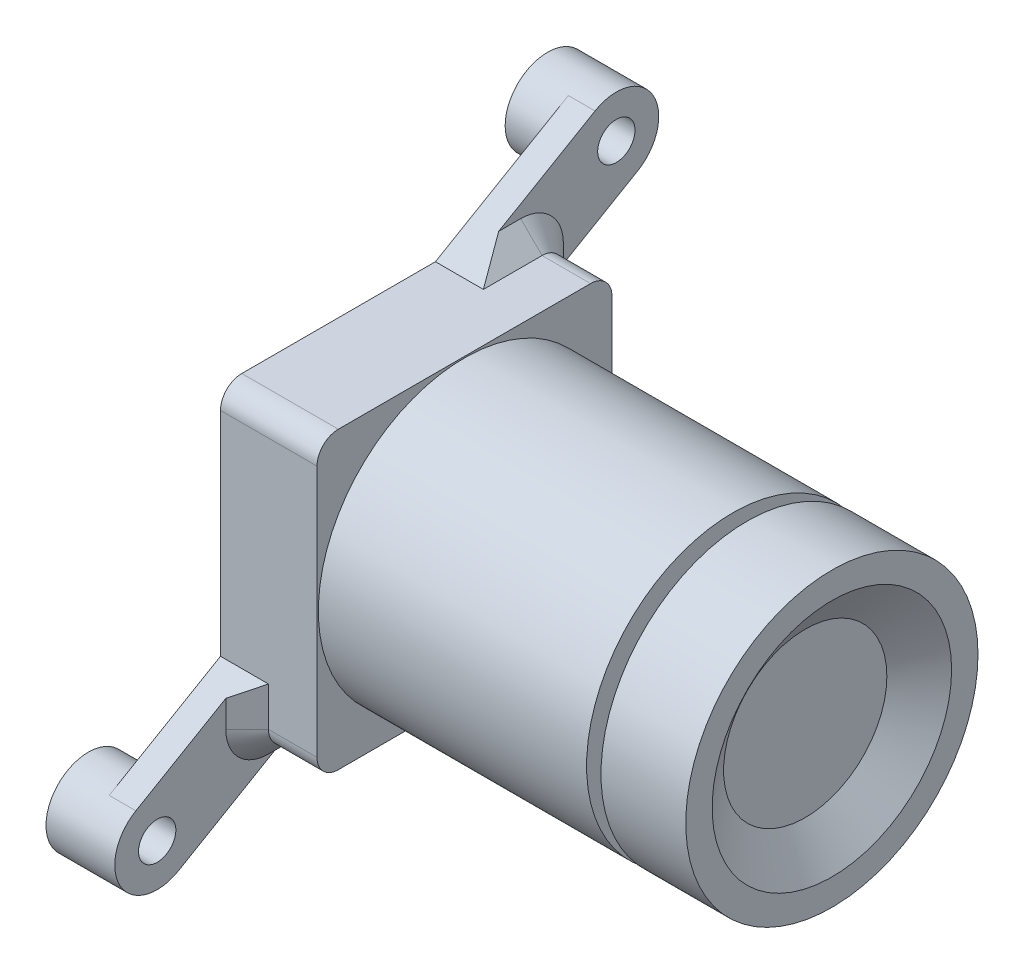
ISO-10303-21;
HEADER;
FILE_DESCRIPTION(('STEP AP214'),'2;1');
FILE_NAME('part.step','',(''),(''),'','','');
FILE_SCHEMA(('AUTOMOTIVE_DESIGN { 1 0 10303 214 1 1 1 1 }'));
ENDSEC;
DATA;
#1=APPLICATION_CONTEXT('core data for automotive mechanical design processes');
#2=APPLICATION_PROTOCOL_DEFINITION('international standard','automotive_design',2000,#1);
#3=PRODUCT_CONTEXT('',#1,'mechanical');
#4=PRODUCT('Part','Part','',(#3));
#5=PRODUCT_RELATED_PRODUCT_CATEGORY('part','',(#4));
#6=PRODUCT_DEFINITION_FORMATION('','',#4);
#7=PRODUCT_DEFINITION_CONTEXT('part definition',#1,'design');
#8=PRODUCT_DEFINITION('design','',#6,#7);
#9=PRODUCT_DEFINITION_SHAPE('','',#8);
#10=(LENGTH_UNIT() NAMED_UNIT(*) SI_UNIT(.MILLI.,.METRE.));
#11=(NAMED_UNIT(*) PLANE_ANGLE_UNIT() SI_UNIT($,.RADIAN.));
#12=(NAMED_UNIT(*) SI_UNIT($,.STERADIAN.) SOLID_ANGLE_UNIT());
#13=UNCERTAINTY_MEASURE_WITH_UNIT(LENGTH_MEASURE(1.E-05),#10,'distance_accuracy_value','');
#14=(GEOMETRIC_REPRESENTATION_CONTEXT(3) GLOBAL_UNCERTAINTY_ASSIGNED_CONTEXT((#13)) GLOBAL_UNIT_ASSIGNED_CONTEXT((#10,
#11,#12)) REPRESENTATION_CONTEXT('',''));
#15=CARTESIAN_POINT('',(0.,0.,0.));
#16=DIRECTION('',(0.,0.,1.));
#17=DIRECTION('',(1.,0.,0.));
#18=AXIS2_PLACEMENT_3D('',#15,#16,#17);
#19=CARTESIAN_POINT('',(-4.5974,-7.0231,7.0231));
#20=DIRECTION('',(1.,0.,0.));
#21=DIRECTION('',(0.,0.,-1.));
#22=AXIS2_PLACEMENT_3D('',#19,#20,#21);
#23=PLANE('',#22);
#24=CARTESIAN_POINT('',(-4.5974,-8.9662,11.3078271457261));
#25=DIRECTION('',(-1.,0.,0.));
#26=DIRECTION('',(0.,0.,1.));
#27=AXIS2_PLACEMENT_3D('',#24,#25,#26);
#28=CIRCLE('',#27,2.0193);
#29=CARTESIAN_POINT('',(-4.5974,-7.22128100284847,12.3241096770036));
#30=VERTEX_POINT('',#29);
#31=CARTESIAN_POINT('',(-4.5974,-10.7111189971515,10.2915446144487));
#32=VERTEX_POINT('',#31);
#33=EDGE_CURVE('E181',#30,#32,#28,.T.);
#34=ORIENTED_EDGE('',*,*,#33,.F.);
#35=DIRECTION('',(0.,0.503284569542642,-0.864120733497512));
#36=VECTOR('',#35,1.);
#37=CARTESIAN_POINT('',(-4.5974,-8.23756353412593,14.0690286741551));
#38=LINE('',#37,#36);
#39=CARTESIAN_POINT('',(-4.5974,-4.13384626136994,7.0231));
#40=VERTEX_POINT('',#39);
#41=EDGE_CURVE('E167',#30,#40,#38,.T.);
#42=ORIENTED_EDGE('',*,*,#41,.T.);
#43=DIRECTION('',(0.,-1.,0.));
#44=VECTOR('',#43,1.);
#45=CARTESIAN_POINT('',(-4.5974,7.0231,7.0231));
#46=LINE('',#45,#44);
#47=CARTESIAN_POINT('',(-4.5974,6.0071,7.0231));
#48=VERTEX_POINT('',#47);
#49=EDGE_CURVE('E268',#48,#40,#46,.T.);
#50=ORIENTED_EDGE('',*,*,#49,.F.);
#51=CARTESIAN_POINT('',(-4.5974,6.0071,6.0071));
#52=DIRECTION('',(1.,0.,0.));
#53=DIRECTION('',(0.,0.,-1.));
#54=AXIS2_PLACEMENT_3D('',#51,#52,#53);
#55=CIRCLE('',#54,1.016);
#56=CARTESIAN_POINT('',(-4.5974,7.0231,6.0071));
#57=VERTEX_POINT('',#56);
#58=EDGE_CURVE('E297',#48,#57,#55,.F.);
#59=ORIENTED_EDGE('',*,*,#58,.T.);
#60=DIRECTION('',(0.,0.,1.));
#61=VECTOR('',#60,1.);
#62=CARTESIAN_POINT('',(-4.5974,7.0231,7.0231));
#63=LINE('',#62,#61);
#64=CARTESIAN_POINT('',(-4.5974,7.0231,-3.2131));
#65=VERTEX_POINT('',#64);
#66=EDGE_CURVE('E276',#65,#57,#63,.T.);
#67=ORIENTED_EDGE('',*,*,#66,.F.);
#68=DIRECTION('',(0.,0.503284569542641,-0.864120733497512));
#69=VECTOR('',#68,1.);
#70=CARTESIAN_POINT('',(-4.5974,7.0231,-3.2131));
#71=LINE('',#70,#69);
#72=CARTESIAN_POINT('',(-4.5974,10.7111189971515,-9.54529032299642));
#73=VERTEX_POINT('',#72);
#74=EDGE_CURVE('E218',#65,#73,#71,.T.);
#75=ORIENTED_EDGE('',*,*,#74,.T.);
#76=CARTESIAN_POINT('',(-4.5974,8.9662,-10.5615728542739));
#77=DIRECTION('',(-1.,0.,0.));
#78=DIRECTION('',(0.,0.,1.));
#79=AXIS2_PLACEMENT_3D('',#76,#77,#78);
#80=CIRCLE('',#79,2.0193);
#81=CARTESIAN_POINT('',(-4.5974,7.22128100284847,-11.5778553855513));
#82=VERTEX_POINT('',#81);
#83=EDGE_CURVE('E11',#82,#73,#80,.T.);
#84=ORIENTED_EDGE('',*,*,#83,.F.);
#85=DIRECTION('',(0.,-0.503284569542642,0.864120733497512));
#86=VECTOR('',#85,1.);
#87=CARTESIAN_POINT('',(-4.5974,4.56848259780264,-7.0231));
#88=LINE('',#87,#86);
#89=CARTESIAN_POINT('',(-4.5974,4.56848259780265,-7.0231));
#90=VERTEX_POINT('',#89);
#91=EDGE_CURVE('E224',#82,#90,#88,.T.);
#92=ORIENTED_EDGE('',*,*,#91,.T.);
#93=DIRECTION('',(0.,1.,0.));
#94=VECTOR('',#93,1.);
#95=CARTESIAN_POINT('',(-4.5974,7.0231,-7.0231));
#96=LINE('',#95,#94);
#97=CARTESIAN_POINT('',(-4.5974,-6.0071,-7.0231));
#98=VERTEX_POINT('',#97);
#99=EDGE_CURVE('E273',#98,#90,#96,.T.);
#100=ORIENTED_EDGE('',*,*,#99,.F.);
#101=CARTESIAN_POINT('',(-4.5974,-6.0071,-6.0071));
#102=DIRECTION('',(1.,0.,0.));
#103=DIRECTION('',(0.,0.,-1.));
#104=AXIS2_PLACEMENT_3D('',#101,#102,#103);
#105=CIRCLE('',#104,1.016);
#106=CARTESIAN_POINT('',(-4.5974,-7.0231,-6.0071));
#107=VERTEX_POINT('',#106);
#108=EDGE_CURVE('E299',#98,#107,#105,.F.);
#109=ORIENTED_EDGE('',*,*,#108,.T.);
#110=DIRECTION('',(0.,0.,-1.));
#111=VECTOR('',#110,1.);
#112=CARTESIAN_POINT('',(-4.5974,-7.0231,7.0231));
#113=LINE('',#112,#111);
#114=CARTESIAN_POINT('',(-4.5974,-7.0231,3.95935429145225));
#115=VERTEX_POINT('',#114);
#116=EDGE_CURVE('E270',#115,#107,#113,.T.);
#117=ORIENTED_EDGE('',*,*,#116,.F.);
#118=DIRECTION('',(0.,-0.503284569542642,0.864120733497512));
#119=VECTOR('',#118,1.);
#120=CARTESIAN_POINT('',(-4.5974,-7.0231,3.95935429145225));
#121=LINE('',#120,#119);
#122=EDGE_CURVE('E177',#115,#32,#121,.T.);
#123=ORIENTED_EDGE('',*,*,#122,.T.);
#124=EDGE_LOOP('',(#34,#42,#50,#59,#67,#75,#84,#92,#100,#109,#117,#123));
#125=FACE_BOUND('',#124,.T.);
#126=ADVANCED_FACE('F30',(#125),#23,.F.);
#127=CARTESIAN_POINT('',(-3.3274,-8.9662,11.3078271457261));
#128=DIRECTION('',(-1.,0.,0.));
#129=DIRECTION('',(0.,0.,1.));
#130=AXIS2_PLACEMENT_3D('',#127,#128,#129);
#131=CYLINDRICAL_SURFACE('',#130,2.0193);
#132=DIRECTION('',(-1.,0.,0.));
#133=VECTOR('',#132,1.);
#134=CARTESIAN_POINT('',(-3.3274,-10.7111189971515,10.2915446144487));
#135=LINE('',#134,#133);
#136=CARTESIAN_POINT('',(-3.3274,-10.7111189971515,10.2915446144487));
#137=VERTEX_POINT('',#136);
#138=EDGE_CURVE('E182',#137,#32,#135,.T.);
#139=ORIENTED_EDGE('',*,*,#138,.F.);
#140=CARTESIAN_POINT('',(-3.3274,-8.9662,11.3078271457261));
#141=DIRECTION('',(1.,0.,0.));
#142=DIRECTION('',(0.,0.,-1.));
#143=AXIS2_PLACEMENT_3D('',#140,#141,#142);
#144=CIRCLE('',#143,2.0193);
#145=CARTESIAN_POINT('',(-3.3274,-7.22128100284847,12.3241096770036));
#146=VERTEX_POINT('',#145);
#147=EDGE_CURVE('E39',#146,#137,#144,.T.);
#148=ORIENTED_EDGE('',*,*,#147,.F.);
#149=DIRECTION('',(-1.,0.,0.));
#150=VECTOR('',#149,1.);
#151=CARTESIAN_POINT('',(-3.3274,-7.22128100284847,12.3241096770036));
#152=LINE('',#151,#150);
#153=EDGE_CURVE('E169',#30,#146,#152,.F.);
#154=ORIENTED_EDGE('',*,*,#153,.F.);
#155=ORIENTED_EDGE('',*,*,#33,.T.);
#156=EDGE_LOOP('',(#139,#148,#154,#155));
#157=FACE_BOUND('',#156,.T.);
#158=CARTESIAN_POINT('',(-6.604,-8.9662,11.3078271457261));
#159=DIRECTION('',(-1.,0.,0.));
#160=DIRECTION('',(0.,0.,1.));
#161=AXIS2_PLACEMENT_3D('',#158,#159,#160);
#162=CIRCLE('',#161,2.0193);
#163=CARTESIAN_POINT('',(-6.604,-8.9662,13.3271271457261));
#164=VERTEX_POINT('',#163);
#165=EDGE_CURVE('E187',#164,#164,#162,.T.);
#166=ORIENTED_EDGE('',*,*,#165,.F.);
#167=EDGE_LOOP('',(#166));
#168=FACE_BOUND('',#167,.T.);
#169=ADVANCED_FACE('F32',(#157,#168),#131,.T.);
#170=CARTESIAN_POINT('',(-3.3274,8.9662,-10.5615728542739));
#171=DIRECTION('',(-1.,0.,0.));
#172=DIRECTION('',(0.,0.,1.));
#173=AXIS2_PLACEMENT_3D('',#170,#171,#172);
#174=CYLINDRICAL_SURFACE('',#173,2.0193);
#175=DIRECTION('',(-1.,0.,0.));
#176=VECTOR('',#175,1.);
#177=CARTESIAN_POINT('',(-3.3274,10.7111189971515,-9.54529032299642));
#178=LINE('',#177,#176);
#179=CARTESIAN_POINT('',(-3.3274,10.7111189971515,-9.54529032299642));
#180=VERTEX_POINT('',#179);
#181=EDGE_CURVE('E349',#180,#73,#178,.T.);
#182=ORIENTED_EDGE('',*,*,#181,.F.);
#183=CARTESIAN_POINT('',(-3.3274,8.9662,-10.5615728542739));
#184=DIRECTION('',(1.,0.,0.));
#185=DIRECTION('',(0.,0.,-1.));
#186=AXIS2_PLACEMENT_3D('',#183,#184,#185);
#187=CIRCLE('',#186,2.0193);
#188=CARTESIAN_POINT('',(-3.3274,7.22128100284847,-11.5778553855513));
#189=VERTEX_POINT('',#188);
#190=EDGE_CURVE('E350',#189,#180,#187,.T.);
#191=ORIENTED_EDGE('',*,*,#190,.F.);
#192=DIRECTION('',(-1.,0.,0.));
#193=VECTOR('',#192,1.);
#194=CARTESIAN_POINT('',(-3.3274,7.22128100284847,-11.5778553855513));
#195=LINE('',#194,#193);
#196=EDGE_CURVE('E352',#82,#189,#195,.F.);
#197=ORIENTED_EDGE('',*,*,#196,.F.);
#198=ORIENTED_EDGE('',*,*,#83,.T.);
#199=EDGE_LOOP('',(#182,#191,#197,#198));
#200=FACE_BOUND('',#199,.T.);
#201=CARTESIAN_POINT('',(-6.604,8.9662,-10.5615728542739));
#202=DIRECTION('',(-1.,0.,0.));
#203=DIRECTION('',(0.,0.,1.));
#204=AXIS2_PLACEMENT_3D('',#201,#202,#203);
#205=CIRCLE('',#204,2.0193);
#206=CARTESIAN_POINT('',(-6.604,8.9662,-8.54227285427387));
#207=VERTEX_POINT('',#206);
#208=EDGE_CURVE('E191',#207,#207,#205,.T.);
#209=ORIENTED_EDGE('',*,*,#208,.F.);
#210=EDGE_LOOP('',(#209));
#211=FACE_BOUND('',#210,.T.);
#212=ADVANCED_FACE('F375',(#200,#211),#174,.T.);
#213=CARTESIAN_POINT('',(12.7762,0.,0.));
#214=DIRECTION('',(1.,0.,0.));
#215=DIRECTION('',(0.,0.,-1.));
#216=AXIS2_PLACEMENT_3D('',#213,#214,#215);
#217=PLANE('',#216);
#218=CARTESIAN_POINT('',(12.7762,0.,0.));
#219=DIRECTION('',(1.,0.,0.));
#220=DIRECTION('',(0.,0.,-1.));
#221=AXIS2_PLACEMENT_3D('',#218,#219,#220);
#222=CIRCLE('',#221,6.9596);
#223=CARTESIAN_POINT('',(12.7762,0.,-6.9596));
#224=VERTEX_POINT('',#223);
#225=EDGE_CURVE('E253',#224,#224,#222,.T.);
#226=ORIENTED_EDGE('',*,*,#225,.T.);
#227=EDGE_LOOP('',(#226));
#228=FACE_BOUND('',#227,.T.);
#229=CARTESIAN_POINT('',(12.7762,0.,0.));
#230=DIRECTION('',(1.,0.,0.));
#231=DIRECTION('',(0.,0.,-1.));
#232=AXIS2_PLACEMENT_3D('',#229,#230,#231);
#233=CIRCLE('',#232,5.5626);
#234=CARTESIAN_POINT('',(12.7762,0.,-5.5626));
#235=VERTEX_POINT('',#234);
#236=EDGE_CURVE('E244',#235,#235,#233,.T.);
#237=ORIENTED_EDGE('',*,*,#236,.F.);
#238=EDGE_LOOP('',(#237));
#239=FACE_BOUND('',#238,.T.);
#240=ADVANCED_FACE('F475',(#228,#239),#217,.T.);
#241=CARTESIAN_POINT('',(0.,-7.0231,7.0231));
#242=DIRECTION('',(1.,0.,0.));
#243=DIRECTION('',(0.,0.,-1.));
#244=AXIS2_PLACEMENT_3D('',#241,#242,#243);
#245=PLANE('',#244);
#246=DIRECTION('',(0.,0.,-1.));
#247=VECTOR('',#246,1.);
#248=CARTESIAN_POINT('',(0.,-7.0231,7.0231));
#249=LINE('',#248,#247);
#250=CARTESIAN_POINT('',(0.,-7.0231,6.0071));
#251=VERTEX_POINT('',#250);
#252=CARTESIAN_POINT('',(0.,-7.0231,-6.0071));
#253=VERTEX_POINT('',#252);
#254=EDGE_CURVE('E259',#251,#253,#249,.T.);
#255=ORIENTED_EDGE('',*,*,#254,.T.);
#256=CARTESIAN_POINT('',(0.,-6.0071,-6.0071));
#257=DIRECTION('',(1.,0.,0.));
#258=DIRECTION('',(0.,0.,-1.));
#259=AXIS2_PLACEMENT_3D('',#256,#257,#258);
#260=CIRCLE('',#259,1.016);
#261=CARTESIAN_POINT('',(0.,-6.0071,-7.0231));
#262=VERTEX_POINT('',#261);
#263=EDGE_CURVE('E291',#253,#262,#260,.T.);
#264=ORIENTED_EDGE('',*,*,#263,.T.);
#265=DIRECTION('',(0.,1.,0.));
#266=VECTOR('',#265,1.);
#267=CARTESIAN_POINT('',(0.,7.0231,-7.0231));
#268=LINE('',#267,#266);
#269=CARTESIAN_POINT('',(0.,6.0071,-7.0231));
#270=VERTEX_POINT('',#269);
#271=EDGE_CURVE('E262',#262,#270,#268,.T.);
#272=ORIENTED_EDGE('',*,*,#271,.T.);
#273=CARTESIAN_POINT('',(0.,6.0071,-6.0071));
#274=DIRECTION('',(1.,0.,0.));
#275=DIRECTION('',(0.,0.,-1.));
#276=AXIS2_PLACEMENT_3D('',#273,#274,#275);
#277=CIRCLE('',#276,1.016);
#278=CARTESIAN_POINT('',(0.,7.0231,-6.0071));
#279=VERTEX_POINT('',#278);
#280=EDGE_CURVE('E289',#270,#279,#277,.T.);
#281=ORIENTED_EDGE('',*,*,#280,.T.);
#282=DIRECTION('',(0.,0.,1.));
#283=VECTOR('',#282,1.);
#284=CARTESIAN_POINT('',(0.,7.0231,7.0231));
#285=LINE('',#284,#283);
#286=CARTESIAN_POINT('',(0.,7.0231,6.0071));
#287=VERTEX_POINT('',#286);
#288=EDGE_CURVE('E265',#279,#287,#285,.T.);
#289=ORIENTED_EDGE('',*,*,#288,.T.);
#290=CARTESIAN_POINT('',(0.,6.0071,6.0071));
#291=DIRECTION('',(1.,0.,0.));
#292=DIRECTION('',(0.,0.,-1.));
#293=AXIS2_PLACEMENT_3D('',#290,#291,#292);
#294=CIRCLE('',#293,1.016);
#295=CARTESIAN_POINT('',(0.,6.0071,7.0231));
#296=VERTEX_POINT('',#295);
#297=EDGE_CURVE('E287',#287,#296,#294,.T.);
#298=ORIENTED_EDGE('',*,*,#297,.T.);
#299=DIRECTION('',(0.,-1.,0.));
#300=VECTOR('',#299,1.);
#301=CARTESIAN_POINT('',(0.,7.0231,7.0231));
#302=LINE('',#301,#300);
#303=CARTESIAN_POINT('',(0.,-6.0071,7.0231));
#304=VERTEX_POINT('',#303);
#305=EDGE_CURVE('E256',#296,#304,#302,.T.);
#306=ORIENTED_EDGE('',*,*,#305,.T.);
#307=CARTESIAN_POINT('',(0.,-6.0071,6.0071));
#308=DIRECTION('',(1.,0.,0.));
#309=DIRECTION('',(0.,0.,-1.));
#310=AXIS2_PLACEMENT_3D('',#307,#308,#309);
#311=CIRCLE('',#310,1.016);
#312=EDGE_CURVE('E285',#304,#251,#311,.T.);
#313=ORIENTED_EDGE('',*,*,#312,.T.);
#314=EDGE_LOOP('',(#255,#264,#272,#281,#289,#298,#306,#313));
#315=FACE_BOUND('',#314,.T.);
#316=CARTESIAN_POINT('',(0.,0.,0.));
#317=DIRECTION('',(1.,0.,0.));
#318=DIRECTION('',(0.,0.,-1.));
#319=AXIS2_PLACEMENT_3D('',#316,#317,#318);
#320=CIRCLE('',#319,6.9596);
#321=CARTESIAN_POINT('',(0.,0.,-6.9596));
#322=VERTEX_POINT('',#321);
#323=EDGE_CURVE('E250',#322,#322,#320,.T.);
#324=ORIENTED_EDGE('',*,*,#323,.F.);
#325=EDGE_LOOP('',(#324));
#326=FACE_BOUND('',#325,.T.);
#327=ADVANCED_FACE('F396',(#315,#326),#245,.T.);
#328=CARTESIAN_POINT('',(-4.5974,7.0231,7.0231));
#329=DIRECTION('',(0.,0.,1.));
#330=DIRECTION('',(0.,-1.,0.));
#331=AXIS2_PLACEMENT_3D('',#328,#329,#330);
#332=PLANE('',#331);
#333=DIRECTION('',(-1.,0.,0.));
#334=VECTOR('',#333,1.);
#335=CARTESIAN_POINT('',(-3.3274,-4.13384626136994,7.0231));
#336=LINE('',#335,#334);
#337=CARTESIAN_POINT('',(-2.31139999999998,-4.13384626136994,7.0231));
#338=VERTEX_POINT('',#337);
#339=EDGE_CURVE('E171',#338,#40,#336,.T.);
#340=ORIENTED_EDGE('',*,*,#339,.F.);
#341=DIRECTION('',(0.,-1.,0.));
#342=VECTOR('',#341,1.);
#343=CARTESIAN_POINT('',(-2.31139999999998,-6.0071,7.0231));
#344=LINE('',#343,#342);
#345=CARTESIAN_POINT('',(-2.31139999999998,-6.0071,7.0231));
#346=VERTEX_POINT('',#345);
#347=EDGE_CURVE('E325',#338,#346,#344,.T.);
#348=ORIENTED_EDGE('',*,*,#347,.T.);
#349=DIRECTION('',(1.,0.,0.));
#350=VECTOR('',#349,1.);
#351=CARTESIAN_POINT('',(-4.5974,-6.0071,7.0231));
#352=LINE('',#351,#350);
#353=EDGE_CURVE('E307',#346,#304,#352,.T.);
#354=ORIENTED_EDGE('',*,*,#353,.T.);
#355=ORIENTED_EDGE('',*,*,#305,.F.);
#356=DIRECTION('',(1.,0.,0.));
#357=VECTOR('',#356,1.);
#358=CARTESIAN_POINT('',(-4.5974,6.0071,7.0231));
#359=LINE('',#358,#357);
#360=EDGE_CURVE('E309',#296,#48,#359,.F.);
#361=ORIENTED_EDGE('',*,*,#360,.T.);
#362=ORIENTED_EDGE('',*,*,#49,.T.);
#363=EDGE_LOOP('',(#340,#348,#354,#355,#361,#362));
#364=FACE_BOUND('',#363,.T.);
#365=ADVANCED_FACE('F421',(#364),#332,.T.);
#366=CARTESIAN_POINT('',(-4.5974,7.0231,7.0231));
#367=DIRECTION('',(0.,1.,0.));
#368=DIRECTION('',(0.,0.,1.));
#369=AXIS2_PLACEMENT_3D('',#366,#367,#368);
#370=PLANE('',#369);
#371=DIRECTION('',(1.,0.,0.));
#372=VECTOR('',#371,1.);
#373=CARTESIAN_POINT('',(-4.5974,7.0231,-6.0071));
#374=LINE('',#373,#372);
#375=CARTESIAN_POINT('',(-2.31139999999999,7.0231,-6.0071));
#376=VERTEX_POINT('',#375);
#377=EDGE_CURVE('E304',#279,#376,#374,.F.);
#378=ORIENTED_EDGE('',*,*,#377,.T.);
#379=DIRECTION('',(0.,0.,1.));
#380=VECTOR('',#379,1.);
#381=CARTESIAN_POINT('',(-2.31139999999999,7.0231,-3.2131));
#382=LINE('',#381,#380);
#383=CARTESIAN_POINT('',(-2.31139999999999,7.0231,-3.2131));
#384=VERTEX_POINT('',#383);
#385=EDGE_CURVE('E311',#376,#384,#382,.T.);
#386=ORIENTED_EDGE('',*,*,#385,.T.);
#387=DIRECTION('',(-1.,0.,0.));
#388=VECTOR('',#387,1.);
#389=CARTESIAN_POINT('',(-3.3274,7.0231,-3.2131));
#390=LINE('',#389,#388);
#391=EDGE_CURVE('E226',#384,#65,#390,.T.);
#392=ORIENTED_EDGE('',*,*,#391,.T.);
#393=ORIENTED_EDGE('',*,*,#66,.T.);
#394=DIRECTION('',(1.,0.,0.));
#395=VECTOR('',#394,1.);
#396=CARTESIAN_POINT('',(-4.5974,7.0231,6.0071));
#397=LINE('',#396,#395);
#398=EDGE_CURVE('E301',#57,#287,#397,.T.);
#399=ORIENTED_EDGE('',*,*,#398,.T.);
#400=ORIENTED_EDGE('',*,*,#288,.F.);
#401=EDGE_LOOP('',(#378,#386,#392,#393,#399,#400));
#402=FACE_BOUND('',#401,.T.);
#403=ADVANCED_FACE('F429',(#402),#370,.T.);
#404=CARTESIAN_POINT('',(-4.5974,7.0231,-7.0231));
#405=DIRECTION('',(0.,0.,-1.));
#406=DIRECTION('',(0.,1.,0.));
#407=AXIS2_PLACEMENT_3D('',#404,#405,#406);
#408=PLANE('',#407);
#409=DIRECTION('',(-1.,0.,0.));
#410=VECTOR('',#409,1.);
#411=CARTESIAN_POINT('',(-3.3274,4.56848259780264,-7.0231));
#412=LINE('',#411,#410);
#413=CARTESIAN_POINT('',(-2.31139999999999,4.56848259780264,-7.0231));
#414=VERTEX_POINT('',#413);
#415=EDGE_CURVE('E227',#414,#90,#412,.T.);
#416=ORIENTED_EDGE('',*,*,#415,.F.);
#417=DIRECTION('',(0.,1.,0.));
#418=VECTOR('',#417,1.);
#419=CARTESIAN_POINT('',(-2.31139999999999,6.0071,-7.0231));
#420=LINE('',#419,#418);
#421=CARTESIAN_POINT('',(-2.31139999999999,6.0071,-7.0231));
#422=VERTEX_POINT('',#421);
#423=EDGE_CURVE('E323',#414,#422,#420,.T.);
#424=ORIENTED_EDGE('',*,*,#423,.T.);
#425=DIRECTION('',(1.,0.,0.));
#426=VECTOR('',#425,1.);
#427=CARTESIAN_POINT('',(-4.5974,6.0071,-7.0231));
#428=LINE('',#427,#426);
#429=EDGE_CURVE('E293',#422,#270,#428,.T.);
#430=ORIENTED_EDGE('',*,*,#429,.T.);
#431=ORIENTED_EDGE('',*,*,#271,.F.);
#432=DIRECTION('',(1.,0.,0.));
#433=VECTOR('',#432,1.);
#434=CARTESIAN_POINT('',(-4.5974,-6.0071,-7.0231));
#435=LINE('',#434,#433);
#436=EDGE_CURVE('E295',#262,#98,#435,.F.);
#437=ORIENTED_EDGE('',*,*,#436,.T.);
#438=ORIENTED_EDGE('',*,*,#99,.T.);
#439=EDGE_LOOP('',(#416,#424,#430,#431,#437,#438));
#440=FACE_BOUND('',#439,.T.);
#441=ADVANCED_FACE('F383',(#440),#408,.T.);
#442=CARTESIAN_POINT('',(-4.5974,-7.0231,7.0231));
#443=DIRECTION('',(0.,-1.,0.));
#444=DIRECTION('',(0.,0.,-1.));
#445=AXIS2_PLACEMENT_3D('',#442,#443,#444);
#446=PLANE('',#445);
#447=DIRECTION('',(1.,0.,0.));
#448=VECTOR('',#447,1.);
#449=CARTESIAN_POINT('',(-4.5974,-7.0231,6.0071));
#450=LINE('',#449,#448);
#451=CARTESIAN_POINT('',(-2.31139999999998,-7.0231,6.0071));
#452=VERTEX_POINT('',#451);
#453=EDGE_CURVE('E279',#251,#452,#450,.F.);
#454=ORIENTED_EDGE('',*,*,#453,.T.);
#455=DIRECTION('',(0.,0.,-1.));
#456=VECTOR('',#455,1.);
#457=CARTESIAN_POINT('',(-2.31139999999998,-7.0231,3.95935429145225));
#458=LINE('',#457,#456);
#459=CARTESIAN_POINT('',(-2.31139999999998,-7.0231,3.95935429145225));
#460=VERTEX_POINT('',#459);
#461=EDGE_CURVE('E337',#452,#460,#458,.T.);
#462=ORIENTED_EDGE('',*,*,#461,.T.);
#463=DIRECTION('',(-1.,0.,0.));
#464=VECTOR('',#463,1.);
#465=CARTESIAN_POINT('',(-3.3274,-7.0231,3.95935429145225));
#466=LINE('',#465,#464);
#467=EDGE_CURVE('E216',#460,#115,#466,.T.);
#468=ORIENTED_EDGE('',*,*,#467,.T.);
#469=ORIENTED_EDGE('',*,*,#116,.T.);
#470=DIRECTION('',(1.,0.,0.));
#471=VECTOR('',#470,1.);
#472=CARTESIAN_POINT('',(-4.5974,-7.0231,-6.0071));
#473=LINE('',#472,#471);
#474=EDGE_CURVE('E282',#107,#253,#473,.T.);
#475=ORIENTED_EDGE('',*,*,#474,.T.);
#476=ORIENTED_EDGE('',*,*,#254,.F.);
#477=EDGE_LOOP('',(#454,#462,#468,#469,#475,#476));
#478=FACE_BOUND('',#477,.T.);
#479=ADVANCED_FACE('F393',(#478),#446,.T.);
#480=CARTESIAN_POINT('',(12.7762,0.,0.));
#481=DIRECTION('',(-1.,0.,0.));
#482=DIRECTION('',(0.,0.,1.));
#483=AXIS2_PLACEMENT_3D('',#480,#481,#482);
#484=CYLINDRICAL_SURFACE('',#483,6.9596);
#485=ORIENTED_EDGE('',*,*,#225,.F.);
#486=EDGE_LOOP('',(#485));
#487=FACE_BOUND('',#486,.T.);
#488=ORIENTED_EDGE('',*,*,#323,.T.);
#489=EDGE_LOOP('',(#488));
#490=FACE_BOUND('',#489,.T.);
#491=ADVANCED_FACE('F472',(#487,#490),#484,.T.);
#492=CARTESIAN_POINT('',(13.462,0.,0.));
#493=DIRECTION('',(-1.,0.,0.));
#494=DIRECTION('',(0.,0.,1.));
#495=AXIS2_PLACEMENT_3D('',#492,#493,#494);
#496=CYLINDRICAL_SURFACE('',#495,5.5626);
#497=CARTESIAN_POINT('',(13.462,0.,0.));
#498=DIRECTION('',(1.,0.,0.));
#499=DIRECTION('',(0.,0.,-1.));
#500=AXIS2_PLACEMENT_3D('',#497,#498,#499);
#501=CIRCLE('',#500,5.5626);
#502=CARTESIAN_POINT('',(13.462,0.,-5.5626));
#503=VERTEX_POINT('',#502);
#504=EDGE_CURVE('E247',#503,#503,#501,.T.);
#505=ORIENTED_EDGE('',*,*,#504,.F.);
#506=EDGE_LOOP('',(#505));
#507=FACE_BOUND('',#506,.T.);
#508=ORIENTED_EDGE('',*,*,#236,.T.);
#509=EDGE_LOOP('',(#508));
#510=FACE_BOUND('',#509,.T.);
#511=ADVANCED_FACE('F486',(#507,#510),#496,.T.);
#512=CARTESIAN_POINT('',(13.462,0.,0.));
#513=DIRECTION('',(1.,0.,0.));
#514=DIRECTION('',(0.,0.,-1.));
#515=AXIS2_PLACEMENT_3D('',#512,#513,#514);
#516=PLANE('',#515);
#517=CARTESIAN_POINT('',(13.462,0.,0.));
#518=DIRECTION('',(1.,0.,0.));
#519=DIRECTION('',(0.,0.,-1.));
#520=AXIS2_PLACEMENT_3D('',#517,#518,#519);
#521=CIRCLE('',#520,6.9596);
#522=CARTESIAN_POINT('',(13.462,0.,-6.9596));
#523=VERTEX_POINT('',#522);
#524=EDGE_CURVE('E238',#523,#523,#521,.T.);
#525=ORIENTED_EDGE('',*,*,#524,.F.);
#526=EDGE_LOOP('',(#525));
#527=FACE_BOUND('',#526,.T.);
#528=ORIENTED_EDGE('',*,*,#504,.T.);
#529=EDGE_LOOP('',(#528));
#530=FACE_BOUND('',#529,.T.);
#531=ADVANCED_FACE('F493',(#527,#530),#516,.F.);
#532=CARTESIAN_POINT('',(17.5006,0.,0.));
#533=DIRECTION('',(-1.,0.,0.));
#534=DIRECTION('',(0.,0.,1.));
#535=AXIS2_PLACEMENT_3D('',#532,#533,#534);
#536=CYLINDRICAL_SURFACE('',#535,6.9596);
#537=CARTESIAN_POINT('',(17.5006,0.,0.));
#538=DIRECTION('',(1.,0.,0.));
#539=DIRECTION('',(0.,0.,-1.));
#540=AXIS2_PLACEMENT_3D('',#537,#538,#539);
#541=CIRCLE('',#540,6.9596);
#542=CARTESIAN_POINT('',(17.5006,0.,-6.9596));
#543=VERTEX_POINT('',#542);
#544=EDGE_CURVE('E241',#543,#543,#541,.T.);
#545=ORIENTED_EDGE('',*,*,#544,.F.);
#546=EDGE_LOOP('',(#545));
#547=FACE_BOUND('',#546,.T.);
#548=ORIENTED_EDGE('',*,*,#524,.T.);
#549=EDGE_LOOP('',(#548));
#550=FACE_BOUND('',#549,.T.);
#551=ADVANCED_FACE('F501',(#547,#550),#536,.T.);
#552=CARTESIAN_POINT('',(17.5006,0.,0.));
#553=DIRECTION('',(1.,0.,0.));
#554=DIRECTION('',(0.,0.,-1.));
#555=AXIS2_PLACEMENT_3D('',#552,#553,#554);
#556=PLANE('',#555);
#557=CARTESIAN_POINT('',(17.5006,0.,0.));
#558=DIRECTION('',(1.,0.,0.));
#559=DIRECTION('',(0.,0.,-1.));
#560=AXIS2_PLACEMENT_3D('',#557,#558,#559);
#561=CIRCLE('',#560,5.7023);
#562=CARTESIAN_POINT('',(17.5006,0.,-5.7023));
#563=VERTEX_POINT('',#562);
#564=EDGE_CURVE('E230',#563,#563,#561,.T.);
#565=ORIENTED_EDGE('',*,*,#564,.F.);
#566=EDGE_LOOP('',(#565));
#567=FACE_BOUND('',#566,.T.);
#568=ORIENTED_EDGE('',*,*,#544,.T.);
#569=EDGE_LOOP('',(#568));
#570=FACE_BOUND('',#569,.T.);
#571=ADVANCED_FACE('F511',(#567,#570),#556,.T.);
#572=CARTESIAN_POINT('',(17.5006,0.,0.));
#573=DIRECTION('',(1.,0.,0.));
#574=DIRECTION('',(0.,0.,-1.));
#575=AXIS2_PLACEMENT_3D('',#572,#573,#574);
#576=CONICAL_SURFACE('',#575,5.7023,0.959931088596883);
#577=CARTESIAN_POINT('',(16.2306,0.,0.));
#578=DIRECTION('',(1.,0.,0.));
#579=DIRECTION('',(0.,0.,-1.));
#580=AXIS2_PLACEMENT_3D('',#577,#578,#579);
#581=CIRCLE('',#580,3.88855203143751);
#582=CARTESIAN_POINT('',(16.2306,0.,-3.88855203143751));
#583=VERTEX_POINT('',#582);
#584=EDGE_CURVE('E235',#583,#583,#581,.T.);
#585=ORIENTED_EDGE('',*,*,#584,.F.);
#586=EDGE_LOOP('',(#585));
#587=FACE_BOUND('',#586,.T.);
#588=ORIENTED_EDGE('',*,*,#564,.T.);
#589=EDGE_LOOP('',(#588));
#590=FACE_BOUND('',#589,.T.);
#591=ADVANCED_FACE('F516',(#587,#590),#576,.F.);
#592=CARTESIAN_POINT('',(16.2306,0.,0.));
#593=DIRECTION('',(1.,0.,0.));
#594=DIRECTION('',(0.,0.,-1.));
#595=AXIS2_PLACEMENT_3D('',#592,#593,#594);
#596=PLANE('',#595);
#597=ORIENTED_EDGE('',*,*,#584,.T.);
#598=EDGE_LOOP('',(#597));
#599=FACE_BOUND('',#598,.T.);
#600=ADVANCED_FACE('F523',(#599),#596,.T.);
#601=CARTESIAN_POINT('',(-3.3274,4.56848259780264,-7.0231));
#602=DIRECTION('',(0.,-0.864120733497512,-0.503284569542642));
#603=DIRECTION('',(0.,0.503284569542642,-0.864120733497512));
#604=AXIS2_PLACEMENT_3D('',#601,#602,#603);
#605=PLANE('',#604);
#606=ORIENTED_EDGE('',*,*,#91,.F.);
#607=ORIENTED_EDGE('',*,*,#196,.T.);
#608=DIRECTION('',(0.,-0.503284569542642,0.864120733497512));
#609=VECTOR('',#608,1.);
#610=CARTESIAN_POINT('',(-3.3274,4.56848259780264,-7.0231));
#611=LINE('',#610,#609);
#612=CARTESIAN_POINT('',(-3.3274,5.16022528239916,-8.0391));
#613=VERTEX_POINT('',#612);
#614=EDGE_CURVE('E223',#189,#613,#611,.T.);
#615=ORIENTED_EDGE('',*,*,#614,.T.);
#616=DIRECTION('',(-0.653829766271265,0.380806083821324,-0.65382976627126));
#617=VECTOR('',#616,1.);
#618=CARTESIAN_POINT('',(-2.92255641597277,4.9244347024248,-7.63425641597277));
#619=LINE('',#618,#617);
#620=EDGE_CURVE('E342',#613,#414,#619,.F.);
#621=ORIENTED_EDGE('',*,*,#620,.T.);
#622=ORIENTED_EDGE('',*,*,#415,.T.);
#623=EDGE_LOOP('',(#606,#607,#615,#621,#622));
#624=FACE_BOUND('',#623,.T.);
#625=ADVANCED_FACE('F379',(#624),#605,.T.);
#626=CARTESIAN_POINT('',(-3.3274,7.0231,-3.2131));
#627=DIRECTION('',(0.,0.864120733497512,0.503284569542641));
#628=DIRECTION('',(0.,-0.503284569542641,0.864120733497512));
#629=AXIS2_PLACEMENT_3D('',#626,#627,#628);
#630=PLANE('',#629);
#631=DIRECTION('',(0.,0.503284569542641,-0.864120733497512));
#632=VECTOR('',#631,1.);
#633=CARTESIAN_POINT('',(-3.3274,7.0231,-3.2131));
#634=LINE('',#633,#632);
#635=CARTESIAN_POINT('',(-3.3274,8.0391,-4.95753390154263));
#636=VERTEX_POINT('',#635);
#637=EDGE_CURVE('E220',#636,#180,#634,.T.);
#638=ORIENTED_EDGE('',*,*,#637,.T.);
#639=ORIENTED_EDGE('',*,*,#181,.T.);
#640=ORIENTED_EDGE('',*,*,#74,.F.);
#641=ORIENTED_EDGE('',*,*,#391,.F.);
#642=DIRECTION('',(0.449559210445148,-0.449559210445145,0.771876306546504));
#643=VECTOR('',#642,1.);
#644=CARTESIAN_POINT('',(1.24060339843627,3.47109660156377,2.88555664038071));
#645=LINE('',#644,#643);
#646=EDGE_CURVE('E340',#384,#636,#645,.F.);
#647=ORIENTED_EDGE('',*,*,#646,.T.);
#648=EDGE_LOOP('',(#638,#639,#640,#641,#647));
#649=FACE_BOUND('',#648,.T.);
#650=ADVANCED_FACE('F372',(#649),#630,.T.);
#651=CARTESIAN_POINT('',(-3.3274,7.0231,-7.0231));
#652=DIRECTION('',(1.,0.,0.));
#653=DIRECTION('',(0.,0.,-1.));
#654=AXIS2_PLACEMENT_3D('',#651,#652,#653);
#655=PLANE('',#654);
#656=CARTESIAN_POINT('',(-3.3274,8.9662,-10.5615728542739));
#657=DIRECTION('',(1.,0.,0.));
#658=DIRECTION('',(0.,0.,-1.));
#659=AXIS2_PLACEMENT_3D('',#656,#657,#658);
#660=CIRCLE('',#659,0.889000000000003);
#661=CARTESIAN_POINT('',(-3.3274,8.9662,-11.4505728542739));
#662=VERTEX_POINT('',#661);
#663=EDGE_CURVE('E188',#662,#662,#660,.T.);
#664=ORIENTED_EDGE('',*,*,#663,.F.);
#665=EDGE_LOOP('',(#664));
#666=FACE_BOUND('',#665,.T.);
#667=ORIENTED_EDGE('',*,*,#614,.F.);
#668=ORIENTED_EDGE('',*,*,#190,.T.);
#669=ORIENTED_EDGE('',*,*,#637,.F.);
#670=DIRECTION('',(0.,0.,-1.));
#671=VECTOR('',#670,1.);
#672=CARTESIAN_POINT('',(-3.3274,8.0391,-6.0071));
#673=LINE('',#672,#671);
#674=CARTESIAN_POINT('',(-3.3274,8.0391,-6.0071));
#675=VERTEX_POINT('',#674);
#676=EDGE_CURVE('E319',#636,#675,#673,.T.);
#677=ORIENTED_EDGE('',*,*,#676,.T.);
#678=CARTESIAN_POINT('',(-3.3274,6.0071,-6.0071));
#679=DIRECTION('',(1.,0.,0.));
#680=DIRECTION('',(0.,0.,-1.));
#681=AXIS2_PLACEMENT_3D('',#678,#679,#680);
#682=CIRCLE('',#681,2.032);
#683=CARTESIAN_POINT('',(-3.3274,6.0071,-8.0391));
#684=VERTEX_POINT('',#683);
#685=EDGE_CURVE('E317',#675,#684,#682,.F.);
#686=ORIENTED_EDGE('',*,*,#685,.T.);
#687=DIRECTION('',(0.,-1.,0.));
#688=VECTOR('',#687,1.);
#689=CARTESIAN_POINT('',(-3.3274,4.56848259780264,-8.0391));
#690=LINE('',#689,#688);
#691=EDGE_CURVE('E314',#684,#613,#690,.T.);
#692=ORIENTED_EDGE('',*,*,#691,.T.);
#693=EDGE_LOOP('',(#667,#668,#669,#677,#686,#692));
#694=FACE_BOUND('',#693,.T.);
#695=ADVANCED_FACE('F446',(#666,#694),#655,.T.);
#696=CARTESIAN_POINT('',(-3.3274,-8.23756353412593,14.0690286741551));
#697=DIRECTION('',(0.,0.864120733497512,0.503284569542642));
#698=DIRECTION('',(0.,-0.503284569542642,0.864120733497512));
#699=AXIS2_PLACEMENT_3D('',#696,#697,#698);
#700=PLANE('',#699);
#701=ORIENTED_EDGE('',*,*,#41,.F.);
#702=ORIENTED_EDGE('',*,*,#153,.T.);
#703=DIRECTION('',(0.,0.503284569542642,-0.864120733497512));
#704=VECTOR('',#703,1.);
#705=CARTESIAN_POINT('',(-3.3274,-8.23756353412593,14.0690286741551));
#706=LINE('',#705,#704);
#707=CARTESIAN_POINT('',(-3.3274,-4.72558894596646,8.03910000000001));
#708=VERTEX_POINT('',#707);
#709=EDGE_CURVE('E214',#146,#708,#706,.T.);
#710=ORIENTED_EDGE('',*,*,#709,.T.);
#711=DIRECTION('',(-0.653829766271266,-0.380806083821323,0.653829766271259));
#712=VECTOR('',#711,1.);
#713=CARTESIAN_POINT('',(0.466482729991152,-2.51594096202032,4.24521727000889));
#714=LINE('',#713,#712);
#715=EDGE_CURVE('E345',#708,#338,#714,.F.);
#716=ORIENTED_EDGE('',*,*,#715,.T.);
#717=ORIENTED_EDGE('',*,*,#339,.T.);
#718=EDGE_LOOP('',(#701,#702,#710,#716,#717));
#719=FACE_BOUND('',#718,.T.);
#720=ADVANCED_FACE('F168',(#719),#700,.T.);
#721=CARTESIAN_POINT('',(-3.3274,-7.0231,3.95935429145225));
#722=DIRECTION('',(0.,-0.864120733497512,-0.503284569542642));
#723=DIRECTION('',(0.,0.503284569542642,-0.864120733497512));
#724=AXIS2_PLACEMENT_3D('',#721,#722,#723);
#725=PLANE('',#724);
#726=DIRECTION('',(0.,-0.503284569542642,0.864120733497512));
#727=VECTOR('',#726,1.);
#728=CARTESIAN_POINT('',(-3.3274,-7.0231,3.95935429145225));
#729=LINE('',#728,#727);
#730=CARTESIAN_POINT('',(-3.3274,-8.0391,5.70378819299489));
#731=VERTEX_POINT('',#730);
#732=EDGE_CURVE('E176',#731,#137,#729,.T.);
#733=ORIENTED_EDGE('',*,*,#732,.T.);
#734=ORIENTED_EDGE('',*,*,#138,.T.);
#735=ORIENTED_EDGE('',*,*,#122,.F.);
#736=ORIENTED_EDGE('',*,*,#467,.F.);
#737=DIRECTION('',(0.44955921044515,0.449559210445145,-0.771876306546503));
#738=VECTOR('',#737,1.);
#739=CARTESIAN_POINT('',(-3.37453233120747,-8.08623233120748,5.78471263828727));
#740=LINE('',#739,#738);
#741=EDGE_CURVE('E347',#460,#731,#740,.F.);
#742=ORIENTED_EDGE('',*,*,#741,.T.);
#743=EDGE_LOOP('',(#733,#734,#735,#736,#742));
#744=FACE_BOUND('',#743,.T.);
#745=ADVANCED_FACE('F545',(#744),#725,.T.);
#746=CARTESIAN_POINT('',(-3.3274,-7.0231,7.0231));
#747=DIRECTION('',(1.,0.,0.));
#748=DIRECTION('',(0.,0.,-1.));
#749=AXIS2_PLACEMENT_3D('',#746,#747,#748);
#750=PLANE('',#749);
#751=CARTESIAN_POINT('',(-3.3274,-8.9662,11.3078271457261));
#752=DIRECTION('',(1.,0.,0.));
#753=DIRECTION('',(0.,0.,-1.));
#754=AXIS2_PLACEMENT_3D('',#751,#752,#753);
#755=CIRCLE('',#754,0.889000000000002);
#756=CARTESIAN_POINT('',(-3.3274,-8.9662,10.4188271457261));
#757=VERTEX_POINT('',#756);
#758=EDGE_CURVE('E716',#757,#757,#755,.T.);
#759=ORIENTED_EDGE('',*,*,#758,.F.);
#760=EDGE_LOOP('',(#759));
#761=FACE_BOUND('',#760,.T.);
#762=ORIENTED_EDGE('',*,*,#709,.F.);
#763=ORIENTED_EDGE('',*,*,#147,.T.);
#764=ORIENTED_EDGE('',*,*,#732,.F.);
#765=DIRECTION('',(0.,0.,1.));
#766=VECTOR('',#765,1.);
#767=CARTESIAN_POINT('',(-3.3274,-8.0391,6.0071));
#768=LINE('',#767,#766);
#769=CARTESIAN_POINT('',(-3.3274,-8.0391,6.0071));
#770=VERTEX_POINT('',#769);
#771=EDGE_CURVE('E328',#731,#770,#768,.T.);
#772=ORIENTED_EDGE('',*,*,#771,.T.);
#773=CARTESIAN_POINT('',(-3.3274,-6.0071,6.0071));
#774=DIRECTION('',(1.,0.,0.));
#775=DIRECTION('',(0.,0.,-1.));
#776=AXIS2_PLACEMENT_3D('',#773,#774,#775);
#777=CIRCLE('',#776,2.03200000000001);
#778=CARTESIAN_POINT('',(-3.3274,-6.0071,8.03910000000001));
#779=VERTEX_POINT('',#778);
#780=EDGE_CURVE('E330',#770,#779,#777,.F.);
#781=ORIENTED_EDGE('',*,*,#780,.T.);
#782=DIRECTION('',(0.,1.,0.));
#783=VECTOR('',#782,1.);
#784=CARTESIAN_POINT('',(-3.3274,-4.13384626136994,8.03910000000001));
#785=LINE('',#784,#783);
#786=EDGE_CURVE('E332',#779,#708,#785,.T.);
#787=ORIENTED_EDGE('',*,*,#786,.T.);
#788=EDGE_LOOP('',(#762,#763,#764,#772,#781,#787));
#789=FACE_BOUND('',#788,.T.);
#790=ADVANCED_FACE('F415',(#761,#789),#750,.T.);
#791=CARTESIAN_POINT('',(-4.5974,-6.0071,-6.0071));
#792=DIRECTION('',(1.,0.,0.));
#793=DIRECTION('',(0.,0.,-1.));
#794=AXIS2_PLACEMENT_3D('',#791,#792,#793);
#795=CYLINDRICAL_SURFACE('',#794,1.016);
#796=ORIENTED_EDGE('',*,*,#108,.F.);
#797=ORIENTED_EDGE('',*,*,#436,.F.);
#798=ORIENTED_EDGE('',*,*,#263,.F.);
#799=ORIENTED_EDGE('',*,*,#474,.F.);
#800=EDGE_LOOP('',(#796,#797,#798,#799));
#801=FACE_BOUND('',#800,.T.);
#802=ADVANCED_FACE('F390',(#801),#795,.T.);
#803=CARTESIAN_POINT('',(-4.5974,6.0071,-6.0071));
#804=DIRECTION('',(1.,0.,0.));
#805=DIRECTION('',(0.,0.,-1.));
#806=AXIS2_PLACEMENT_3D('',#803,#804,#805);
#807=CYLINDRICAL_SURFACE('',#806,1.016);
#808=ORIENTED_EDGE('',*,*,#429,.F.);
#809=CARTESIAN_POINT('',(-2.31139999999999,6.0071,-6.0071));
#810=DIRECTION('',(1.,0.,0.));
#811=DIRECTION('',(0.,0.,-1.));
#812=AXIS2_PLACEMENT_3D('',#809,#810,#811);
#813=CIRCLE('',#812,1.016);
#814=EDGE_CURVE('E321',#422,#376,#813,.T.);
#815=ORIENTED_EDGE('',*,*,#814,.T.);
#816=ORIENTED_EDGE('',*,*,#377,.F.);
#817=ORIENTED_EDGE('',*,*,#280,.F.);
#818=EDGE_LOOP('',(#808,#815,#816,#817));
#819=FACE_BOUND('',#818,.T.);
#820=ADVANCED_FACE('F433',(#819),#807,.T.);
#821=CARTESIAN_POINT('',(-4.5974,6.0071,6.0071));
#822=DIRECTION('',(1.,0.,0.));
#823=DIRECTION('',(0.,0.,-1.));
#824=AXIS2_PLACEMENT_3D('',#821,#822,#823);
#825=CYLINDRICAL_SURFACE('',#824,1.016);
#826=ORIENTED_EDGE('',*,*,#58,.F.);
#827=ORIENTED_EDGE('',*,*,#360,.F.);
#828=ORIENTED_EDGE('',*,*,#297,.F.);
#829=ORIENTED_EDGE('',*,*,#398,.F.);
#830=EDGE_LOOP('',(#826,#827,#828,#829));
#831=FACE_BOUND('',#830,.T.);
#832=ADVANCED_FACE('F426',(#831),#825,.T.);
#833=CARTESIAN_POINT('',(-4.5974,-6.0071,6.0071));
#834=DIRECTION('',(1.,0.,0.));
#835=DIRECTION('',(0.,0.,-1.));
#836=AXIS2_PLACEMENT_3D('',#833,#834,#835);
#837=CYLINDRICAL_SURFACE('',#836,1.016);
#838=ORIENTED_EDGE('',*,*,#353,.F.);
#839=CARTESIAN_POINT('',(-2.31139999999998,-6.0071,6.0071));
#840=DIRECTION('',(1.,0.,0.));
#841=DIRECTION('',(0.,0.,-1.));
#842=AXIS2_PLACEMENT_3D('',#839,#840,#841);
#843=CIRCLE('',#842,1.016);
#844=EDGE_CURVE('E335',#346,#452,#843,.T.);
#845=ORIENTED_EDGE('',*,*,#844,.T.);
#846=ORIENTED_EDGE('',*,*,#453,.F.);
#847=ORIENTED_EDGE('',*,*,#312,.F.);
#848=EDGE_LOOP('',(#838,#845,#846,#847));
#849=FACE_BOUND('',#848,.T.);
#850=ADVANCED_FACE('F402',(#849),#837,.T.);
#851=CARTESIAN_POINT('',(-2.31139999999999,7.0231,-7.0231));
#852=DIRECTION('',(0.707106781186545,0.,-0.70710678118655));
#853=DIRECTION('',(-0.70710678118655,0.,-0.707106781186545));
#854=AXIS2_PLACEMENT_3D('',#851,#852,#853);
#855=PLANE('',#854);
#856=ORIENTED_EDGE('',*,*,#620,.F.);
#857=ORIENTED_EDGE('',*,*,#691,.F.);
#858=DIRECTION('',(-0.70710678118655,0.,-0.707106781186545));
#859=VECTOR('',#858,1.);
#860=CARTESIAN_POINT('',(-2.31139999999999,6.0071,-7.0231));
#861=LINE('',#860,#859);
#862=EDGE_CURVE('E208',#422,#684,#861,.T.);
#863=ORIENTED_EDGE('',*,*,#862,.F.);
#864=ORIENTED_EDGE('',*,*,#423,.F.);
#865=EDGE_LOOP('',(#856,#857,#863,#864));
#866=FACE_BOUND('',#865,.T.);
#867=ADVANCED_FACE('F449',(#866),#855,.T.);
#868=CARTESIAN_POINT('',(-3.3274,6.0071,-6.0071));
#869=DIRECTION('',(-1.,0.,0.));
#870=DIRECTION('',(0.,0.,1.));
#871=AXIS2_PLACEMENT_3D('',#868,#869,#870);
#872=CONICAL_SURFACE('',#871,2.032,0.785398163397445);
#873=ORIENTED_EDGE('',*,*,#862,.T.);
#874=ORIENTED_EDGE('',*,*,#685,.F.);
#875=DIRECTION('',(-0.70710678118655,0.707106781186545,0.));
#876=VECTOR('',#875,1.);
#877=CARTESIAN_POINT('',(-2.31139999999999,7.0231,-6.0071));
#878=LINE('',#877,#876);
#879=EDGE_CURVE('E205',#376,#675,#878,.T.);
#880=ORIENTED_EDGE('',*,*,#879,.F.);
#881=ORIENTED_EDGE('',*,*,#814,.F.);
#882=EDGE_LOOP('',(#873,#874,#880,#881));
#883=FACE_BOUND('',#882,.T.);
#884=ADVANCED_FACE('F440',(#883),#872,.T.);
#885=CARTESIAN_POINT('',(-2.31139999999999,7.0231,7.0231));
#886=DIRECTION('',(0.707106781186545,0.70710678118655,0.));
#887=DIRECTION('',(-0.70710678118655,0.707106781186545,0.));
#888=AXIS2_PLACEMENT_3D('',#885,#886,#887);
#889=PLANE('',#888);
#890=ORIENTED_EDGE('',*,*,#879,.T.);
#891=ORIENTED_EDGE('',*,*,#676,.F.);
#892=ORIENTED_EDGE('',*,*,#646,.F.);
#893=ORIENTED_EDGE('',*,*,#385,.F.);
#894=EDGE_LOOP('',(#890,#891,#892,#893));
#895=FACE_BOUND('',#894,.T.);
#896=ADVANCED_FACE('F444',(#895),#889,.T.);
#897=CARTESIAN_POINT('',(-2.31139999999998,-7.0231,7.0231));
#898=DIRECTION('',(0.707106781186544,-0.707106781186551,0.));
#899=DIRECTION('',(0.707106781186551,0.707106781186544,0.));
#900=AXIS2_PLACEMENT_3D('',#897,#898,#899);
#901=PLANE('',#900);
#902=ORIENTED_EDGE('',*,*,#741,.F.);
#903=ORIENTED_EDGE('',*,*,#461,.F.);
#904=DIRECTION('',(0.707106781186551,0.707106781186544,0.));
#905=VECTOR('',#904,1.);
#906=CARTESIAN_POINT('',(-3.3274,-8.0391,6.0071));
#907=LINE('',#906,#905);
#908=EDGE_CURVE('E202',#770,#452,#907,.T.);
#909=ORIENTED_EDGE('',*,*,#908,.F.);
#910=ORIENTED_EDGE('',*,*,#771,.F.);
#911=EDGE_LOOP('',(#902,#903,#909,#910));
#912=FACE_BOUND('',#911,.T.);
#913=ADVANCED_FACE('F408',(#912),#901,.T.);
#914=CARTESIAN_POINT('',(-3.3274,-6.0071,6.0071));
#915=DIRECTION('',(-1.,0.,0.));
#916=DIRECTION('',(0.,0.,1.));
#917=AXIS2_PLACEMENT_3D('',#914,#915,#916);
#918=CONICAL_SURFACE('',#917,2.03200000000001,0.785398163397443);
#919=ORIENTED_EDGE('',*,*,#908,.T.);
#920=ORIENTED_EDGE('',*,*,#844,.F.);
#921=DIRECTION('',(0.707106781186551,0.,-0.707106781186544));
#922=VECTOR('',#921,1.);
#923=CARTESIAN_POINT('',(-3.3274,-6.0071,8.03910000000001));
#924=LINE('',#923,#922);
#925=EDGE_CURVE('E200',#779,#346,#924,.T.);
#926=ORIENTED_EDGE('',*,*,#925,.F.);
#927=ORIENTED_EDGE('',*,*,#780,.F.);
#928=EDGE_LOOP('',(#919,#920,#926,#927));
#929=FACE_BOUND('',#928,.T.);
#930=ADVANCED_FACE('F412',(#929),#918,.T.);
#931=CARTESIAN_POINT('',(-2.31139999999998,7.0231,7.0231));
#932=DIRECTION('',(0.707106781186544,0.,0.707106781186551));
#933=DIRECTION('',(0.707106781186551,0.,-0.707106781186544));
#934=AXIS2_PLACEMENT_3D('',#931,#932,#933);
#935=PLANE('',#934);
#936=ORIENTED_EDGE('',*,*,#715,.F.);
#937=ORIENTED_EDGE('',*,*,#786,.F.);
#938=ORIENTED_EDGE('',*,*,#925,.T.);
#939=ORIENTED_EDGE('',*,*,#347,.F.);
#940=EDGE_LOOP('',(#936,#937,#938,#939));
#941=FACE_BOUND('',#940,.T.);
#942=ADVANCED_FACE('F418',(#941),#935,.T.);
#943=CARTESIAN_POINT('',(-6.604,8.9662,-10.5615728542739));
#944=DIRECTION('',(-1.,0.,0.));
#945=DIRECTION('',(0.,0.,1.));
#946=AXIS2_PLACEMENT_3D('',#943,#944,#945);
#947=PLANE('',#946);
#948=CARTESIAN_POINT('',(-6.604,8.9662,-10.5615728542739));
#949=DIRECTION('',(-1.,0.,0.));
#950=DIRECTION('',(0.,0.,1.));
#951=AXIS2_PLACEMENT_3D('',#948,#949,#950);
#952=CIRCLE('',#951,0.889000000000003);
#953=CARTESIAN_POINT('',(-6.604,8.9662,-9.67257285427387));
#954=VERTEX_POINT('',#953);
#955=EDGE_CURVE('E194',#954,#954,#952,.T.);
#956=ORIENTED_EDGE('',*,*,#955,.F.);
#957=EDGE_LOOP('',(#956));
#958=FACE_BOUND('',#957,.T.);
#959=ORIENTED_EDGE('',*,*,#208,.T.);
#960=EDGE_LOOP('',(#959));
#961=FACE_BOUND('',#960,.T.);
#962=ADVANCED_FACE('F615',(#958,#961),#947,.T.);
#963=CARTESIAN_POINT('',(-6.604,-8.9662,11.3078271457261));
#964=DIRECTION('',(-1.,0.,0.));
#965=DIRECTION('',(0.,0.,1.));
#966=AXIS2_PLACEMENT_3D('',#963,#964,#965);
#967=PLANE('',#966);
#968=CARTESIAN_POINT('',(-6.604,-8.9662,11.3078271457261));
#969=DIRECTION('',(-1.,0.,0.));
#970=DIRECTION('',(0.,0.,1.));
#971=AXIS2_PLACEMENT_3D('',#968,#969,#970);
#972=CIRCLE('',#971,0.889000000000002);
#973=CARTESIAN_POINT('',(-6.604,-8.9662,12.1968271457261));
#974=VERTEX_POINT('',#973);
#975=EDGE_CURVE('E719',#974,#974,#972,.T.);
#976=ORIENTED_EDGE('',*,*,#975,.F.);
#977=EDGE_LOOP('',(#976));
#978=FACE_BOUND('',#977,.T.);
#979=ORIENTED_EDGE('',*,*,#165,.T.);
#980=EDGE_LOOP('',(#979));
#981=FACE_BOUND('',#980,.T.);
#982=ADVANCED_FACE('F679',(#978,#981),#967,.T.);
#983=CARTESIAN_POINT('',(17.5006,8.9662,-10.5615728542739));
#984=DIRECTION('',(-1.,0.,0.));
#985=DIRECTION('',(0.,0.,1.));
#986=AXIS2_PLACEMENT_3D('',#983,#984,#985);
#987=CYLINDRICAL_SURFACE('',#986,0.889000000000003);
#988=ORIENTED_EDGE('',*,*,#663,.T.);
#989=EDGE_LOOP('',(#988));
#990=FACE_BOUND('',#989,.T.);
#991=ORIENTED_EDGE('',*,*,#955,.T.);
#992=EDGE_LOOP('',(#991));
#993=FACE_BOUND('',#992,.T.);
#994=ADVANCED_FACE('F689',(#990,#993),#987,.F.);
#995=CARTESIAN_POINT('',(17.5006,-8.9662,11.3078271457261));
#996=DIRECTION('',(-1.,0.,0.));
#997=DIRECTION('',(0.,0.,1.));
#998=AXIS2_PLACEMENT_3D('',#995,#996,#997);
#999=CYLINDRICAL_SURFACE('',#998,0.889000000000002);
#1000=ORIENTED_EDGE('',*,*,#758,.T.);
#1001=EDGE_LOOP('',(#1000));
#1002=FACE_BOUND('',#1001,.T.);
#1003=ORIENTED_EDGE('',*,*,#975,.T.);
#1004=EDGE_LOOP('',(#1003));
#1005=FACE_BOUND('',#1004,.T.);
#1006=ADVANCED_FACE('F699',(#1002,#1005),#999,.F.);
#1007=CLOSED_SHELL('',(#126,#169,#212,#240,#327,#365,#403,#441,#479,#491,#511,#531,#551,#571,
#591,#600,#625,#650,#695,#720,#745,#790,#802,#820,#832,#850,#867,#884,#896,#913,#930,#942,#962,
#982,#994,#1006));
#1008=MANIFOLD_SOLID_BREP('B2',#1007);
#1009=ADVANCED_BREP_SHAPE_REPRESENTATION('',(#18,#1008),#14);
#1010=SHAPE_DEFINITION_REPRESENTATION(#9,#1009);
ENDSEC;
END-ISO-10303-21;
